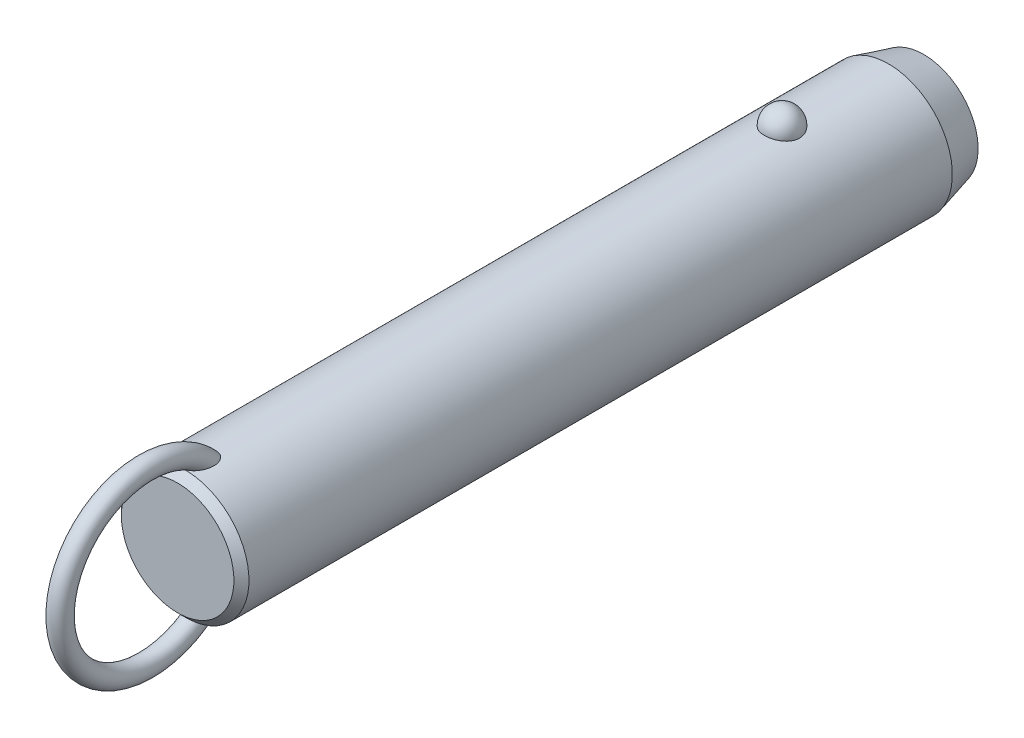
ISO-10303-21;
HEADER;
FILE_DESCRIPTION(('STEP AP214'),'2;1');
FILE_NAME('part.step','',(''),(''),'','','');
FILE_SCHEMA(('AUTOMOTIVE_DESIGN { 1 0 10303 214 1 1 1 1 }'));
ENDSEC;
DATA;
#1=APPLICATION_CONTEXT('core data for automotive mechanical design processes');
#2=APPLICATION_PROTOCOL_DEFINITION('international standard','automotive_design',2000,#1);
#3=PRODUCT_CONTEXT('',#1,'mechanical');
#4=PRODUCT('Part','Part','',(#3));
#5=PRODUCT_RELATED_PRODUCT_CATEGORY('part','',(#4));
#6=PRODUCT_DEFINITION_FORMATION('','',#4);
#7=PRODUCT_DEFINITION_CONTEXT('part definition',#1,'design');
#8=PRODUCT_DEFINITION('design','',#6,#7);
#9=PRODUCT_DEFINITION_SHAPE('','',#8);
#10=(LENGTH_UNIT() NAMED_UNIT(*) SI_UNIT(.MILLI.,.METRE.));
#11=(NAMED_UNIT(*) PLANE_ANGLE_UNIT() SI_UNIT($,.RADIAN.));
#12=(NAMED_UNIT(*) SI_UNIT($,.STERADIAN.) SOLID_ANGLE_UNIT());
#13=UNCERTAINTY_MEASURE_WITH_UNIT(LENGTH_MEASURE(1.E-05),#10,'distance_accuracy_value','');
#14=(GEOMETRIC_REPRESENTATION_CONTEXT(3) GLOBAL_UNCERTAINTY_ASSIGNED_CONTEXT((#13)) GLOBAL_UNIT_ASSIGNED_CONTEXT((#10,
#11,#12)) REPRESENTATION_CONTEXT('',''));
#15=CARTESIAN_POINT('',(0.,0.,0.));
#16=DIRECTION('',(0.,0.,1.));
#17=DIRECTION('',(1.,0.,0.));
#18=AXIS2_PLACEMENT_3D('',#15,#16,#17);
#19=CARTESIAN_POINT('',(0.,0.,104.1));
#20=DIRECTION('',(0.,0.,-1.));
#21=DIRECTION('',(-1.,0.,0.));
#22=AXIS2_PLACEMENT_3D('',#19,#20,#21);
#23=CYLINDRICAL_SURFACE('',#22,12.7);
#24=CARTESIAN_POINT('',(3.46661256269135,12.2177165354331,-3.5));
#25=CARTESIAN_POINT('',(3.4666090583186,12.2177194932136,-3.30432790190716));
#26=CARTESIAN_POINT('',(3.45063567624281,12.2222841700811,-3.10861112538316));
#27=CARTESIAN_POINT('',(3.38712451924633,12.2400345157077,-2.72271899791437));
#28=CARTESIAN_POINT('',(3.33957415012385,12.2532236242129,-2.53254588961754));
#29=CARTESIAN_POINT('',(3.2141234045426,12.286724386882,-2.16324948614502));
#30=CARTESIAN_POINT('',(3.13623639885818,12.3070329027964,-1.98412136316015));
#31=CARTESIAN_POINT('',(2.95205930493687,12.3525018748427,-1.64180592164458));
#32=CARTESIAN_POINT('',(2.84577003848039,12.3776621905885,-1.47861814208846));
#33=CARTESIAN_POINT('',(2.60688050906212,12.4301712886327,-1.17190583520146));
#34=CARTESIAN_POINT('',(2.47415697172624,12.4575299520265,-1.02847897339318));
#35=CARTESIAN_POINT('',(2.18615174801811,12.5112810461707,-0.766177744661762));
#36=CARTESIAN_POINT('',(2.03087002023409,12.5376734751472,-0.64730342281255));
#37=CARTESIAN_POINT('',(1.70237334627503,12.5864761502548,-0.437732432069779));
#38=CARTESIAN_POINT('',(1.52920948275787,12.6088972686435,-0.346958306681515));
#39=CARTESIAN_POINT('',(1.16944170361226,12.6473352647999,-0.195750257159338));
#40=CARTESIAN_POINT('',(0.982839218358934,12.663352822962,-0.135313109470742));
#41=CARTESIAN_POINT('',(0.604961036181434,12.6869706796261,-0.0473241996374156));
#42=CARTESIAN_POINT('',(0.41382314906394,12.6947125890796,-0.0192185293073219));
#43=CARTESIAN_POINT('',(0.0293827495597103,12.7014203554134,0.0051725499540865));
#44=CARTESIAN_POINT('',(-0.163919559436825,12.7003870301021,0.00146092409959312));
#45=CARTESIAN_POINT('',(-0.544374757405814,12.689735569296,-0.0373939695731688));
#46=CARTESIAN_POINT('',(-0.731575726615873,12.6802364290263,-0.0721015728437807));
#47=CARTESIAN_POINT('',(-1.09733277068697,12.6538333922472,-0.171364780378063));
#48=CARTESIAN_POINT('',(-1.27588869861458,12.6369293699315,-0.235920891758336));
#49=CARTESIAN_POINT('',(-1.6204698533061,12.5973946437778,-0.393548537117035));
#50=CARTESIAN_POINT('',(-1.78641865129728,12.5747321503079,-0.486778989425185));
#51=CARTESIAN_POINT('',(-2.10030671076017,12.5261316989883,-0.699110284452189));
#52=CARTESIAN_POINT('',(-2.24824419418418,12.5001934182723,-0.818213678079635));
#53=CARTESIAN_POINT('',(-2.52491489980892,12.4472906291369,-1.08157124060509));
#54=CARTESIAN_POINT('',(-2.65324222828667,12.4203160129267,-1.22624992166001));
#55=CARTESIAN_POINT('',(-2.88410007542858,12.3687509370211,-1.53528325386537));
#56=CARTESIAN_POINT('',(-2.98662883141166,12.3441606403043,-1.69963924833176));
#57=CARTESIAN_POINT('',(-3.16432417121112,12.2998199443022,-2.04548497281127));
#58=CARTESIAN_POINT('',(-3.23917525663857,12.2801261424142,-2.22714424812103));
#59=CARTESIAN_POINT('',(-3.35800573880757,12.248167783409,-2.6009138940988));
#60=CARTESIAN_POINT('',(-3.4019860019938,12.2359030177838,-2.79302397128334));
#61=CARTESIAN_POINT('',(-3.45784812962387,12.2202347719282,-3.18140279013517));
#62=CARTESIAN_POINT('',(-3.46986123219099,12.2167950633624,-3.37765118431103));
#63=CARTESIAN_POINT('',(-3.46186273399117,12.2190638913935,-3.76943689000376));
#64=CARTESIAN_POINT('',(-3.44185196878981,12.2247721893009,-3.96497421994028));
#65=CARTESIAN_POINT('',(-3.37048652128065,12.2446381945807,-4.34881728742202));
#66=CARTESIAN_POINT('',(-3.31928253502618,12.2587552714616,-4.53715319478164));
#67=CARTESIAN_POINT('',(-3.18693461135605,12.2938237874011,-4.90231727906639));
#68=CARTESIAN_POINT('',(-3.1057895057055,12.3147754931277,-5.07914500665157));
#69=CARTESIAN_POINT('',(-2.91506431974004,12.3613125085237,-5.41732059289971));
#70=CARTESIAN_POINT('',(-2.80533587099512,12.3869217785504,-5.57858147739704));
#71=CARTESIAN_POINT('',(-2.560414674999,12.4398525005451,-5.88013283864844));
#72=CARTESIAN_POINT('',(-2.42522099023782,12.4671740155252,-6.02042254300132));
#73=CARTESIAN_POINT('',(-2.1323357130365,12.5205965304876,-6.27662798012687));
#74=CARTESIAN_POINT('',(-1.97456596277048,12.5466928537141,-6.3924554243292));
#75=CARTESIAN_POINT('',(-1.64115839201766,12.5946384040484,-6.59583547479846));
#76=CARTESIAN_POINT('',(-1.46552179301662,12.6164879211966,-6.68339001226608));
#77=CARTESIAN_POINT('',(-1.10356050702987,12.6532533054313,-6.82682153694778));
#78=CARTESIAN_POINT('',(-0.9173913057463,12.6682500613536,-6.8830698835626));
#79=CARTESIAN_POINT('',(-0.537836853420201,12.6900288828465,-6.96386887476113));
#80=CARTESIAN_POINT('',(-0.344452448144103,12.6968119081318,-6.9884232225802));
#81=CARTESIAN_POINT('',(0.0402577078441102,12.7013667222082,-7.00496469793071));
#82=CARTESIAN_POINT('',(0.231556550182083,12.6993008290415,-6.99753844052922));
#83=CARTESIAN_POINT('',(0.610105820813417,12.6867505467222,-6.9516636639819));
#84=CARTESIAN_POINT('',(0.797356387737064,12.6762664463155,-6.913216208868));
#85=CARTESIAN_POINT('',(1.16186657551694,12.6480587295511,-6.80658431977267));
#86=CARTESIAN_POINT('',(1.33915951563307,12.6303611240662,-6.73850666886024));
#87=CARTESIAN_POINT('',(1.67968518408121,12.5896027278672,-6.5745087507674));
#88=CARTESIAN_POINT('',(1.84291705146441,12.5665416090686,-6.47858678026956));
#89=CARTESIAN_POINT('',(2.15340192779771,12.5171072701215,-6.25982455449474));
#90=CARTESIAN_POINT('',(2.30037831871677,12.4906895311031,-6.13660186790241));
#91=CARTESIAN_POINT('',(2.5717412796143,12.4376567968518,-5.86739587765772));
#92=CARTESIAN_POINT('',(2.69612388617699,12.4110417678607,-5.72140858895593));
#93=CARTESIAN_POINT('',(2.92107785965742,12.360051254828,-5.40794137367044));
#94=CARTESIAN_POINT('',(3.02121329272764,12.3357209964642,-5.24014110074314));
#95=CARTESIAN_POINT('',(3.19236291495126,12.2925446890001,-4.88969865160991));
#96=CARTESIAN_POINT('',(3.26338839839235,12.2736965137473,-4.70706226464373));
#97=CARTESIAN_POINT('',(3.36788038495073,12.245404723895,-4.35469510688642));
#98=CARTESIAN_POINT('',(3.40484026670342,12.2351018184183,-4.18605935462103));
#99=CARTESIAN_POINT('',(3.45420764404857,12.2212564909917,-3.84496058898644));
#100=CARTESIAN_POINT('',(3.46661565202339,12.2177139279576,-3.67249765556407));
#101=CARTESIAN_POINT('',(3.46661256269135,12.2177165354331,-3.5));
#102=B_SPLINE_CURVE_WITH_KNOTS('',3,(#24,#25,#26,#27,#28,#29,#30,#31,#32,#33,#34,#35,#36,#37,
#38,#39,#40,#41,#42,#43,#44,#45,#46,#47,#48,#49,#50,#51,#52,#53,#54,#55,#56,#57,#58,#59,#60,#61,
#62,#63,#64,#65,#66,#67,#68,#69,#70,#71,#72,#73,#74,#75,#76,#77,#78,#79,#80,#81,#82,#83,#84,#85,
#86,#87,#88,#89,#90,#91,#92,#93,#94,#95,#96,#97,#98,#99,#100,#101),.UNSPECIFIED.,.T.,.F.,(4,2,2,
2,2,2,2,2,2,2,2,2,2,2,2,2,2,2,2,2,2,2,2,2,2,2,2,2,2,2,2,2,2,2,2,2,2,2,4),(0.,0.586396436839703,
1.17302689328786,1.7593990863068,2.34575431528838,2.93491084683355,3.52406845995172,
4.11158733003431,4.69904375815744,5.2762784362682,5.85345931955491,6.42265312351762,
6.99185659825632,7.56427334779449,8.136746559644,8.71981013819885,9.3029135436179,
9.89247258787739,10.4820150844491,11.0691335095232,11.6562366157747,12.2405256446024,
12.8248374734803,13.412244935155,13.9996740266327,14.5891883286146,15.1786623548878,
15.7609861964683,16.3432419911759,16.9148635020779,17.4864654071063,18.0560241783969,
18.6256177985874,19.2037609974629,19.7820055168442,20.3699810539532,20.957728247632,
21.4746855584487,21.9916320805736),.UNSPECIFIED.);
#103=CARTESIAN_POINT('',(3.46661256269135,12.2177165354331,-3.5));
#104=VERTEX_POINT('',#103);
#105=EDGE_CURVE('E41',#104,#104,#102,.T.);
#106=ORIENTED_EDGE('',*,*,#105,.T.);
#107=EDGE_LOOP('',(#106));
#108=FACE_BOUND('',#107,.T.);
#109=CARTESIAN_POINT('',(0.,0.,115.3));
#110=DIRECTION('',(0.,0.,1.));
#111=DIRECTION('',(1.,0.,0.));
#112=AXIS2_PLACEMENT_3D('',#109,#110,#111);
#113=CIRCLE('',#112,12.7);
#114=CARTESIAN_POINT('',(-12.7,0.,115.3));
#115=VERTEX_POINT('',#114);
#116=EDGE_CURVE('E10',#115,#115,#113,.F.);
#117=ORIENTED_EDGE('',*,*,#116,.T.);
#118=EDGE_LOOP('',(#117));
#119=FACE_BOUND('',#118,.T.);
#120=CARTESIAN_POINT('',(-0.548122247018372,-12.6881662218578,109.043218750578));
#121=CARTESIAN_POINT('',(-0.648865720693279,-12.6838128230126,109.077926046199));
#122=CARTESIAN_POINT('',(-0.746398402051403,-12.6783867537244,109.122042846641));
#123=CARTESIAN_POINT('',(-0.93212506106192,-12.666091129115,109.226764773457));
#124=CARTESIAN_POINT('',(-1.02030388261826,-12.6592192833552,109.287396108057));
#125=CARTESIAN_POINT('',(-1.18487740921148,-12.6448747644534,109.421847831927));
#126=CARTESIAN_POINT('',(-1.26134296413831,-12.637406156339,109.495582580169));
#127=CARTESIAN_POINT('',(-1.4023120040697,-12.6225412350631,109.653604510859));
#128=CARTESIAN_POINT('',(-1.46681470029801,-12.6151449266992,109.73789238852));
#129=CARTESIAN_POINT('',(-1.60714786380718,-12.5981718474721,109.949657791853));
#130=CARTESIAN_POINT('',(-1.67725126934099,-12.588900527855,110.080962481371));
#131=CARTESIAN_POINT('',(-1.79536591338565,-12.5725964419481,110.353247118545));
#132=CARTESIAN_POINT('',(-1.84333535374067,-12.5655679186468,110.494244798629));
#133=CARTESIAN_POINT('',(-1.93422576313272,-12.5519624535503,110.837645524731));
#134=CARTESIAN_POINT('',(-1.96788773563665,-12.5466298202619,111.042557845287));
#135=CARTESIAN_POINT('',(-1.9941399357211,-12.542463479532,111.351760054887));
#136=CARTESIAN_POINT('',(-1.99883864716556,-12.5417153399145,111.455298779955));
#137=CARTESIAN_POINT('',(-2.00078003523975,-12.5414074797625,111.66245124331));
#138=CARTESIAN_POINT('',(-1.99802449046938,-12.5418474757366,111.766064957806));
#139=CARTESIAN_POINT('',(-1.98336733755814,-12.5441750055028,112.010320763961));
#140=CARTESIAN_POINT('',(-1.96851430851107,-12.5465291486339,112.150780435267));
#141=CARTESIAN_POINT('',(-1.92707089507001,-12.5529612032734,112.429960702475));
#142=CARTESIAN_POINT('',(-1.90047458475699,-12.5570399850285,112.568680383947));
#143=CARTESIAN_POINT('',(-1.83619120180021,-12.5666008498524,112.84341135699));
#144=CARTESIAN_POINT('',(-1.79850828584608,-12.57208240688,112.979423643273));
#145=CARTESIAN_POINT('',(-1.71223796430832,-12.5841228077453,113.247842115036));
#146=CARTESIAN_POINT('',(-1.66365679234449,-12.5906810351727,113.380250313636));
#147=CARTESIAN_POINT('',(-1.5780450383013,-12.6016176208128,113.58548877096));
#148=CARTESIAN_POINT('',(-1.54477252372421,-12.6057501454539,113.659914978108));
#149=CARTESIAN_POINT('',(-1.47424480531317,-12.6141930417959,113.806839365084));
#150=CARTESIAN_POINT('',(-1.43699041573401,-12.6185033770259,113.879337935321));
#151=CARTESIAN_POINT('',(-1.35825795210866,-12.6272207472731,114.021892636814));
#152=CARTESIAN_POINT('',(-1.31678520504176,-12.6316276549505,114.091951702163));
#153=CARTESIAN_POINT('',(-1.22917793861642,-12.6404532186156,114.229070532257));
#154=CARTESIAN_POINT('',(-1.18304514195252,-12.6448718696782,114.296131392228));
#155=CARTESIAN_POINT('',(-1.07246411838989,-12.6547893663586,114.443874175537));
#156=CARTESIAN_POINT('',(-1.00642239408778,-12.6602600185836,114.523384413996));
#157=CARTESIAN_POINT('',(-0.864441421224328,-12.6707460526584,114.673169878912));
#158=CARTESIAN_POINT('',(-0.78851691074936,-12.6757620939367,114.743458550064));
#159=CARTESIAN_POINT('',(-0.652215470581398,-12.6833591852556,114.848680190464));
#160=CARTESIAN_POINT('',(-0.594982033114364,-12.6861973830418,114.887624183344));
#161=CARTESIAN_POINT('',(-0.475269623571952,-12.6912445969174,114.956489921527));
#162=CARTESIAN_POINT('',(-0.412800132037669,-12.6934547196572,114.986427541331));
#163=CARTESIAN_POINT('',(-0.295749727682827,-12.6966636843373,115.029756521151));
#164=CARTESIAN_POINT('',(-0.241949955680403,-12.6978134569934,115.045218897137));
#165=CARTESIAN_POINT('',(-0.132508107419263,-12.6994261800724,115.066884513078));
#166=CARTESIAN_POINT('',(-0.0768679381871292,-12.6998898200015,115.073097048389));
#167=CARTESIAN_POINT('',(0.0347696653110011,-12.7000752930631,115.075583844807));
#168=CARTESIAN_POINT('',(0.0907676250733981,-12.6997954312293,115.071835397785));
#169=CARTESIAN_POINT('',(0.201283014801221,-12.6985255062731,115.054788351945));
#170=CARTESIAN_POINT('',(0.255799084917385,-12.6975348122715,115.041481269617));
#171=CARTESIAN_POINT('',(0.376042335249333,-12.6946091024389,115.00203792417));
#172=CARTESIAN_POINT('',(0.44095085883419,-12.6924943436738,114.973449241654));
#173=CARTESIAN_POINT('',(0.565350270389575,-12.6875639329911,114.906323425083));
#174=CARTESIAN_POINT('',(0.624828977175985,-12.6847467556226,114.867764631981));
#175=CARTESIAN_POINT('',(0.774116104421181,-12.6767252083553,114.756949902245));
#176=CARTESIAN_POINT('',(0.859449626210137,-12.6711344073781,114.678760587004));
#177=CARTESIAN_POINT('',(1.01789440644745,-12.6593922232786,114.510943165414));
#178=CARTESIAN_POINT('',(1.09096902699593,-12.653239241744,114.421282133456));
#179=CARTESIAN_POINT('',(1.22268793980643,-12.6411674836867,114.240265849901));
#180=CARTESIAN_POINT('',(1.28193986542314,-12.6352572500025,114.149345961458));
#181=CARTESIAN_POINT('',(1.39259777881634,-12.6235401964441,113.962792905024));
#182=CARTESIAN_POINT('',(1.44399707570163,-12.6177334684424,113.867155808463));
#183=CARTESIAN_POINT('',(1.53972870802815,-12.6064093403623,113.672273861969));
#184=CARTESIAN_POINT('',(1.58405262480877,-12.6008922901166,113.573024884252));
#185=CARTESIAN_POINT('',(1.66600705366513,-12.5903187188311,113.371772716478));
#186=CARTESIAN_POINT('',(1.70363651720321,-12.5852622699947,113.269769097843));
#187=CARTESIAN_POINT('',(1.77545379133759,-12.5753406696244,113.054358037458));
#188=CARTESIAN_POINT('',(1.80903453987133,-12.5705328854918,112.940745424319));
#189=CARTESIAN_POINT('',(1.86844163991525,-12.5618400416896,112.711457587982));
#190=CARTESIAN_POINT('',(1.89426665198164,-12.5579551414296,112.595782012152));
#191=CARTESIAN_POINT('',(1.9378546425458,-12.5513030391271,112.363007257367));
#192=CARTESIAN_POINT('',(1.9556264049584,-12.5485346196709,112.245909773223));
#193=CARTESIAN_POINT('',(1.98264463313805,-12.5442934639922,112.010747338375));
#194=CARTESIAN_POINT('',(1.99189298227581,-12.5428204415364,111.89268260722));
#195=CARTESIAN_POINT('',(2.00416068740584,-12.540871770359,111.580622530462));
#196=CARTESIAN_POINT('',(1.99944433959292,-12.541631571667,111.386229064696));
#197=CARTESIAN_POINT('',(1.96113755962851,-12.5476846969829,111.000309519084));
#198=CARTESIAN_POINT('',(1.92758341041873,-12.5529723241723,110.808780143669));
#199=CARTESIAN_POINT('',(1.83934342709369,-12.5661532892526,110.482272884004));
#200=CARTESIAN_POINT('',(1.79215440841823,-12.5730485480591,110.34524997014));
#201=CARTESIAN_POINT('',(1.67676242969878,-12.588958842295,110.080445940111));
#202=CARTESIAN_POINT('',(1.60859050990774,-12.597970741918,109.952651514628));
#203=CARTESIAN_POINT('',(1.46583832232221,-12.6152829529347,109.735800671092));
#204=CARTESIAN_POINT('',(1.39525727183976,-12.6233659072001,109.64410500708));
#205=CARTESIAN_POINT('',(1.23992594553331,-12.6395676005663,109.473485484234));
#206=CARTESIAN_POINT('',(1.1551793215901,-12.6476863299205,109.394558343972));
#207=CARTESIAN_POINT('',(0.971995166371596,-12.6630846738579,109.252643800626));
#208=CARTESIAN_POINT('',(0.873456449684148,-12.6703572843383,109.189784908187));
#209=CARTESIAN_POINT('',(0.665847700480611,-12.6829569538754,109.084487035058));
#210=CARTESIAN_POINT('',(0.556784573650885,-12.688285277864,109.042034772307));
#211=CARTESIAN_POINT('',(0.347338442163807,-12.6956226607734,108.984443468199));
#212=CARTESIAN_POINT('',(0.247759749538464,-12.6979816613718,108.966399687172));
#213=CARTESIAN_POINT('',(0.0470218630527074,-12.7003077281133,108.948600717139));
#214=CARTESIAN_POINT('',(-0.0541350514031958,-12.7002779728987,108.948821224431));
#215=CARTESIAN_POINT('',(-0.221414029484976,-12.6982482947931,108.964363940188));
#216=CARTESIAN_POINT('',(-0.288055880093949,-12.6969033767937,108.974666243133));
#217=CARTESIAN_POINT('',(-0.419599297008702,-12.6932369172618,109.00313489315));
#218=CARTESIAN_POINT('',(-0.484501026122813,-12.6909154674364,109.021300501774));
#219=CARTESIAN_POINT('',(-0.548122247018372,-12.6881662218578,109.043218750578));
#220=B_SPLINE_CURVE_WITH_KNOTS('',3,(#120,#121,#122,#123,#124,#125,#126,#127,#128,#129,#130,
#131,#132,#133,#134,#135,#136,#137,#138,#139,#140,#141,#142,#143,#144,#145,#146,#147,#148,#149,
#150,#151,#152,#153,#154,#155,#156,#157,#158,#159,#160,#161,#162,#163,#164,#165,#166,#167,#168,
#169,#170,#171,#172,#173,#174,#175,#176,#177,#178,#179,#180,#181,#182,#183,#184,#185,#186,#187,
#188,#189,#190,#191,#192,#193,#194,#195,#196,#197,#198,#199,#200,#201,#202,#203,#204,#205,#206,
#207,#208,#209,#210,#211,#212,#213,#214,#215,#216,#217,#218,#219),.UNSPECIFIED.,.T.,.F.,(4,2,2,
2,2,2,2,2,2,2,2,2,2,2,2,2,2,2,2,2,2,2,2,2,2,2,2,2,2,2,2,2,2,2,2,2,2,2,2,2,2,2,2,2,2,2,2,2,2,4),
(0.,0.31964225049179,0.639794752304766,0.957927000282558,1.27608021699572,1.72100165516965,
2.16675988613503,2.78630021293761,3.0970578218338,3.40774128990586,3.83096358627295,
4.2543996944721,4.67767724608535,5.10071330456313,5.34550297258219,5.59024267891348,
5.83467707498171,6.07902143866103,6.38891080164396,6.69834321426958,6.90560910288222,
7.11250749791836,7.27977315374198,7.44687060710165,7.61434932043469,7.78197685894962,
7.99365544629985,8.20579780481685,8.55147335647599,8.89816429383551,9.22375138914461,
9.5496143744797,9.87586224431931,10.202161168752,10.557587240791,10.9130746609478,
11.2681734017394,11.6231936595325,12.2046601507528,12.7853961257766,13.219164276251,
13.6522938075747,13.9989174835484,14.3454519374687,14.6946768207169,15.0436740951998,
15.3457513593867,15.6474266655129,15.8493051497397,16.0511646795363),.UNSPECIFIED.);
#221=CARTESIAN_POINT('',(-0.548122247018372,-12.6881662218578,109.043218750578));
#222=VERTEX_POINT('',#221);
#223=EDGE_CURVE('E59',#222,#222,#220,.T.);
#224=ORIENTED_EDGE('',*,*,#223,.T.);
#225=EDGE_LOOP('',(#224));
#226=FACE_BOUND('',#225,.T.);
#227=CARTESIAN_POINT('',(-0.548122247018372,12.6881662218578,109.043218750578));
#228=CARTESIAN_POINT('',(-0.459436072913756,12.6919968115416,109.012673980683));
#229=CARTESIAN_POINT('',(-0.368189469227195,12.6949996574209,108.989391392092));
#230=CARTESIAN_POINT('',(-0.183024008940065,12.6990186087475,108.958406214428));
#231=CARTESIAN_POINT('',(-0.0891049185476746,12.7000345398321,108.950704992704));
#232=CARTESIAN_POINT('',(0.0987147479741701,12.6999636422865,108.951245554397));
#233=CARTESIAN_POINT('',(0.192615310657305,12.6988761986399,108.959492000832));
#234=CARTESIAN_POINT('',(0.377658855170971,12.6947211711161,108.991551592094));
#235=CARTESIAN_POINT('',(0.468801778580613,12.6916535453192,109.015365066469));
#236=CARTESIAN_POINT('',(0.645809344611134,12.6838788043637,109.07745651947));
#237=CARTESIAN_POINT('',(0.731679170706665,12.6791733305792,109.115720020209));
#238=CARTESIAN_POINT('',(0.896315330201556,12.6686004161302,109.205120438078));
#239=CARTESIAN_POINT('',(0.975080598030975,12.6627328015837,109.256259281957));
#240=CARTESIAN_POINT('',(1.12963655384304,12.6499161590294,109.37367820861));
#241=CARTESIAN_POINT('',(1.20478673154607,12.6429194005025,109.440792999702));
#242=CARTESIAN_POINT('',(1.34448241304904,12.6288282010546,109.58522507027));
#243=CARTESIAN_POINT('',(1.40902173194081,12.621733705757,109.662548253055));
#244=CARTESIAN_POINT('',(1.55208211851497,12.6050877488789,109.859247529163));
#245=CARTESIAN_POINT('',(1.62510490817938,12.5957546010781,109.982654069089));
#246=CARTESIAN_POINT('',(1.7501904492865,12.5789823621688,110.239769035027));
#247=CARTESIAN_POINT('',(1.80221377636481,12.5715468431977,110.373496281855));
#248=CARTESIAN_POINT('',(1.90309965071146,12.5567434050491,110.698351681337));
#249=CARTESIAN_POINT('',(1.94342317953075,12.5504515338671,110.892161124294));
#250=CARTESIAN_POINT('',(1.99332997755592,12.5426147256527,111.28378810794));
#251=CARTESIAN_POINT('',(2.00285305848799,12.5410790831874,111.481612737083));
#252=CARTESIAN_POINT('',(1.99678999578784,12.5420407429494,111.816642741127));
#253=CARTESIAN_POINT('',(1.98794117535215,12.5434564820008,111.954042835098));
#254=CARTESIAN_POINT('',(1.95865119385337,12.5480641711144,112.227639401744));
#255=CARTESIAN_POINT('',(1.93820436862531,12.5512569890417,112.363835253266));
#256=CARTESIAN_POINT('',(1.88647896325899,12.5591352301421,112.634249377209));
#257=CARTESIAN_POINT('',(1.85518800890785,12.5638223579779,112.76846520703));
#258=CARTESIAN_POINT('',(1.78217886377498,12.5743868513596,113.033936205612));
#259=CARTESIAN_POINT('',(1.74046509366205,12.5802637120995,113.165192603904));
#260=CARTESIAN_POINT('',(1.66024095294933,12.5910571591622,113.386085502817));
#261=CARTESIAN_POINT('',(1.62434772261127,12.5957535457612,113.476690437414));
#262=CARTESIAN_POINT('',(1.5470900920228,12.6054762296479,113.655512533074));
#263=CARTESIAN_POINT('',(1.50572681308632,12.6105024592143,113.743730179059));
#264=CARTESIAN_POINT('',(1.41728020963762,12.620748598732,113.916932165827));
#265=CARTESIAN_POINT('',(1.37021377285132,12.625967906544,114.001925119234));
#266=CARTESIAN_POINT('',(1.2696962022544,12.6364721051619,114.168007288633));
#267=CARTESIAN_POINT('',(1.21624929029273,12.6417569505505,114.249099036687));
#268=CARTESIAN_POINT('',(1.10304413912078,12.6521331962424,114.404702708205));
#269=CARTESIAN_POINT('',(1.04340936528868,12.657226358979,114.479303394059));
#270=CARTESIAN_POINT('',(0.91591933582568,12.6670906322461,114.621324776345));
#271=CARTESIAN_POINT('',(0.84806456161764,12.6718617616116,114.68874589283));
#272=CARTESIAN_POINT('',(0.717035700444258,12.67987711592,114.800624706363));
#273=CARTESIAN_POINT('',(0.655526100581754,12.6832377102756,114.846997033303));
#274=CARTESIAN_POINT('',(0.525985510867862,12.6892676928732,114.929619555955));
#275=CARTESIAN_POINT('',(0.45796984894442,12.6919386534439,114.965892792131));
#276=CARTESIAN_POINT('',(0.334859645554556,12.695691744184,115.016657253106));
#277=CARTESIAN_POINT('',(0.281116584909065,12.6970073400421,115.034373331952));
#278=CARTESIAN_POINT('',(0.171425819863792,12.6989609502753,115.060642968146));
#279=CARTESIAN_POINT('',(0.11548082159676,12.699599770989,115.069207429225));
#280=CARTESIAN_POINT('',(0.00272618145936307,12.7001251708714,115.076253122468));
#281=CARTESIAN_POINT('',(-0.0540859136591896,12.7000089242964,115.074696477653));
#282=CARTESIAN_POINT('',(-0.166544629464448,12.6990328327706,115.061600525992));
#283=CARTESIAN_POINT('',(-0.222190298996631,12.6981724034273,115.050053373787));
#284=CARTESIAN_POINT('',(-0.342018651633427,12.695562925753,115.014912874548));
#285=CARTESIAN_POINT('',(-0.405606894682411,12.6936676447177,114.98933225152));
#286=CARTESIAN_POINT('',(-0.527815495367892,12.6891754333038,114.928311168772));
#287=CARTESIAN_POINT('',(-0.586425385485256,12.6865770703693,114.892850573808));
#288=CARTESIAN_POINT('',(-0.731842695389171,12.6792129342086,114.791496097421));
#289=CARTESIAN_POINT('',(-0.814709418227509,12.6740767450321,114.7200395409));
#290=CARTESIAN_POINT('',(-0.969101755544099,12.6632083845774,114.56589007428));
#291=CARTESIAN_POINT('',(-1.04059564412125,12.6574746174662,114.483166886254));
#292=CARTESIAN_POINT('',(-1.16981116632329,12.6461638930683,114.315809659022));
#293=CARTESIAN_POINT('',(-1.22811369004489,12.6405994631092,114.231616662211));
#294=CARTESIAN_POINT('',(-1.33743405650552,12.6295007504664,114.058579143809));
#295=CARTESIAN_POINT('',(-1.38844577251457,12.6239664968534,113.969730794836));
#296=CARTESIAN_POINT('',(-1.48400702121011,12.6130898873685,113.788389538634));
#297=CARTESIAN_POINT('',(-1.52854232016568,12.6077479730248,113.695889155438));
#298=CARTESIAN_POINT('',(-1.6115011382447,12.5974127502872,113.508160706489));
#299=CARTESIAN_POINT('',(-1.64992317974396,12.5924195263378,113.412931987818));
#300=CARTESIAN_POINT('',(-1.73468589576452,12.581070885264,113.18289362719));
#301=CARTESIAN_POINT('',(-1.77831261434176,12.5749388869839,113.047066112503));
#302=CARTESIAN_POINT('',(-1.85439734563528,12.5639437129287,112.772212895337));
#303=CARTESIAN_POINT('',(-1.88684994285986,12.5590811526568,112.633185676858));
#304=CARTESIAN_POINT('',(-1.94008483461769,12.550968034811,112.35309235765));
#305=CARTESIAN_POINT('',(-1.96088706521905,12.5477147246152,112.212030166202));
#306=CARTESIAN_POINT('',(-1.99000539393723,12.5431291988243,111.928668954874));
#307=CARTESIAN_POINT('',(-1.99832911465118,12.5417958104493,111.786370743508));
#308=CARTESIAN_POINT('',(-2.00166624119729,12.5412674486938,111.457627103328));
#309=CARTESIAN_POINT('',(-1.99178843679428,12.5428579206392,111.271088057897));
#310=CARTESIAN_POINT('',(-1.9445518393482,12.5502731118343,110.90162404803));
#311=CARTESIAN_POINT('',(-1.90724032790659,12.5560905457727,110.718693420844));
#312=CARTESIAN_POINT('',(-1.81330718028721,12.5699462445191,110.404848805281));
#313=CARTESIAN_POINT('',(-1.76338820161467,12.5771273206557,110.271910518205));
#314=CARTESIAN_POINT('',(-1.64305018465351,12.593414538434,110.015681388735));
#315=CARTESIAN_POINT('',(-1.57265346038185,12.6025185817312,109.892380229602));
#316=CARTESIAN_POINT('',(-1.42634956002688,12.6198178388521,109.683564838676));
#317=CARTESIAN_POINT('',(-1.35423772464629,12.6278405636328,109.595384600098));
#318=CARTESIAN_POINT('',(-1.19645664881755,12.6437632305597,109.432107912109));
#319=CARTESIAN_POINT('',(-1.11080536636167,12.6516633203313,109.356994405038));
#320=CARTESIAN_POINT('',(-0.947219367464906,12.6648319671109,109.237811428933));
#321=CARTESIAN_POINT('',(-0.871624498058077,12.670300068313,109.190541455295));
#322=CARTESIAN_POINT('',(-0.714161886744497,12.6801492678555,109.1077413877));
#323=CARTESIAN_POINT('',(-0.632295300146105,12.684530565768,109.07220913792));
#324=CARTESIAN_POINT('',(-0.548122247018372,12.6881662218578,109.043218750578));
#325=B_SPLINE_CURVE_WITH_KNOTS('',3,(#227,#228,#229,#230,#231,#232,#233,#234,#235,#236,#237,
#238,#239,#240,#241,#242,#243,#244,#245,#246,#247,#248,#249,#250,#251,#252,#253,#254,#255,#256,
#257,#258,#259,#260,#261,#262,#263,#264,#265,#266,#267,#268,#269,#270,#271,#272,#273,#274,#275,
#276,#277,#278,#279,#280,#281,#282,#283,#284,#285,#286,#287,#288,#289,#290,#291,#292,#293,#294,
#295,#296,#297,#298,#299,#300,#301,#302,#303,#304,#305,#306,#307,#308,#309,#310,#311,#312,#313,
#314,#315,#316,#317,#318,#319,#320,#321,#322,#323,#324),.UNSPECIFIED.,.T.,.F.,(4,2,2,2,2,2,2,2,
2,2,2,2,2,2,2,2,2,2,2,2,2,2,2,2,2,2,2,2,2,2,2,2,2,2,2,2,2,2,2,2,2,2,2,2,2,2,2,2,4),(0.,
0.281328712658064,0.562682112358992,0.844117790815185,1.12555942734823,1.40671982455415,
1.68792232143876,1.98972294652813,2.29169886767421,2.72039860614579,3.14989948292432,
3.74084916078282,4.33295293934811,4.74554109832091,5.15833092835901,5.57159335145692,
5.98468079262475,6.2772277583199,6.56971484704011,6.86135609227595,7.15280542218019,
7.43927407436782,7.72572595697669,7.95635862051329,8.18646071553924,8.35559393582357,
8.52452541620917,8.69408946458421,8.86378678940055,9.06834348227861,9.27332014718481,
9.60010414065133,9.92778432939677,10.2350252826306,10.5425229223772,10.8506864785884,
11.1589244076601,11.5867893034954,12.0148612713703,12.4421984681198,12.8692745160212,
13.4279365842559,13.9856380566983,14.4107062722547,14.8353130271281,15.1765567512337,
15.5173516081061,15.7844129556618,16.051425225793),.UNSPECIFIED.);
#326=CARTESIAN_POINT('',(-0.548122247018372,12.6881662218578,109.043218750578));
#327=VERTEX_POINT('',#326);
#328=EDGE_CURVE('E66',#327,#327,#325,.T.);
#329=ORIENTED_EDGE('',*,*,#328,.T.);
#330=EDGE_LOOP('',(#329));
#331=FACE_BOUND('',#330,.T.);
#332=CARTESIAN_POINT('',(0.,0.,-24.6999999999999));
#333=DIRECTION('',(0.,0.,-1.));
#334=DIRECTION('',(-1.,0.,0.));
#335=AXIS2_PLACEMENT_3D('',#332,#333,#334);
#336=CIRCLE('',#335,12.7);
#337=CARTESIAN_POINT('',(-12.7,0.,-24.6999999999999));
#338=VERTEX_POINT('',#337);
#339=EDGE_CURVE('E56',#338,#338,#336,.F.);
#340=ORIENTED_EDGE('',*,*,#339,.T.);
#341=EDGE_LOOP('',(#340));
#342=FACE_BOUND('',#341,.T.);
#343=ADVANCED_FACE('F37',(#108,#119,#226,#331,#342),#23,.T.);
#344=CARTESIAN_POINT('',(0.,0.,-31.7));
#345=DIRECTION('',(0.,0.,-1.));
#346=DIRECTION('',(-1.,0.,0.));
#347=AXIS2_PLACEMENT_3D('',#344,#345,#346);
#348=PLANE('',#347);
#349=CARTESIAN_POINT('',(0.,0.,-31.7));
#350=DIRECTION('',(0.,0.,-1.));
#351=DIRECTION('',(-1.,0.,0.));
#352=AXIS2_PLACEMENT_3D('',#349,#350,#351);
#353=CIRCLE('',#352,10.8243556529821);
#354=CARTESIAN_POINT('',(-10.8243556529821,0.,-31.7));
#355=VERTEX_POINT('',#354);
#356=EDGE_CURVE('E65',#355,#355,#353,.T.);
#357=ORIENTED_EDGE('',*,*,#356,.T.);
#358=EDGE_LOOP('',(#357));
#359=FACE_BOUND('',#358,.T.);
#360=ADVANCED_FACE('F84',(#359),#348,.T.);
#361=CARTESIAN_POINT('',(0.,0.,-31.7));
#362=DIRECTION('',(0.,0.,1.));
#363=DIRECTION('',(1.,0.,0.));
#364=AXIS2_PLACEMENT_3D('',#361,#362,#363);
#365=CONICAL_SURFACE('',#364,10.8243556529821,0.261799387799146);
#366=ORIENTED_EDGE('',*,*,#339,.F.);
#367=EDGE_LOOP('',(#366));
#368=FACE_BOUND('',#367,.T.);
#369=ORIENTED_EDGE('',*,*,#356,.F.);
#370=EDGE_LOOP('',(#369));
#371=FACE_BOUND('',#370,.T.);
#372=ADVANCED_FACE('F82',(#368,#371),#365,.T.);
#373=CARTESIAN_POINT('',(0.,0.,116.8));
#374=DIRECTION('',(0.,0.,1.));
#375=DIRECTION('',(1.,0.,0.));
#376=AXIS2_PLACEMENT_3D('',#373,#374,#375);
#377=PLANE('',#376);
#378=CARTESIAN_POINT('',(0.,0.,116.8));
#379=DIRECTION('',(0.,0.,1.));
#380=DIRECTION('',(1.,0.,0.));
#381=AXIS2_PLACEMENT_3D('',#378,#379,#380);
#382=CIRCLE('',#381,11.2);
#383=CARTESIAN_POINT('',(-11.2,0.,116.8));
#384=VERTEX_POINT('',#383);
#385=EDGE_CURVE('E50',#384,#384,#382,.T.);
#386=ORIENTED_EDGE('',*,*,#385,.T.);
#387=EDGE_LOOP('',(#386));
#388=FACE_BOUND('',#387,.T.);
#389=ADVANCED_FACE('F76',(#388),#377,.T.);
#390=CARTESIAN_POINT('',(0.,0.,123.15));
#391=DIRECTION('',(1.,0.,0.));
#392=DIRECTION('',(0.,0.,-1.));
#393=AXIS2_PLACEMENT_3D('',#390,#391,#392);
#394=TOROIDAL_SURFACE('',#393,17.05,2.);
#395=ORIENTED_EDGE('',*,*,#328,.F.);
#396=EDGE_LOOP('',(#395));
#397=FACE_BOUND('',#396,.T.);
#398=ORIENTED_EDGE('',*,*,#223,.F.);
#399=EDGE_LOOP('',(#398));
#400=FACE_BOUND('',#399,.T.);
#401=ADVANCED_FACE('F72',(#397,#400),#394,.T.);
#402=CARTESIAN_POINT('',(0.,0.,116.8));
#403=DIRECTION('',(0.,0.,-1.));
#404=DIRECTION('',(-1.,0.,0.));
#405=AXIS2_PLACEMENT_3D('',#402,#403,#404);
#406=CONICAL_SURFACE('',#405,11.2,0.785398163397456);
#407=CARTESIAN_POINT('',(-12.7,0.,115.3));
#408=CARTESIAN_POINT('',(-12.684375,0.,115.315625));
#409=CARTESIAN_POINT('',(-12.66875,0.,115.33125));
#410=CARTESIAN_POINT('',(-12.6375,0.,115.3625));
#411=CARTESIAN_POINT('',(-12.621875,0.,115.378125));
#412=CARTESIAN_POINT('',(-12.590625,0.,115.409375));
#413=CARTESIAN_POINT('',(-12.575,0.,115.425));
#414=CARTESIAN_POINT('',(-12.54375,0.,115.45625));
#415=CARTESIAN_POINT('',(-12.528125,0.,115.471875));
#416=CARTESIAN_POINT('',(-12.496875,0.,115.503125));
#417=CARTESIAN_POINT('',(-12.48125,0.,115.51875));
#418=CARTESIAN_POINT('',(-12.45,0.,115.55));
#419=CARTESIAN_POINT('',(-12.434375,0.,115.565625));
#420=CARTESIAN_POINT('',(-12.403125,0.,115.596875));
#421=CARTESIAN_POINT('',(-12.3875,0.,115.6125));
#422=CARTESIAN_POINT('',(-12.35625,0.,115.64375));
#423=CARTESIAN_POINT('',(-12.340625,0.,115.659375));
#424=CARTESIAN_POINT('',(-12.309375,0.,115.690625));
#425=CARTESIAN_POINT('',(-12.29375,0.,115.70625));
#426=CARTESIAN_POINT('',(-12.2625,0.,115.7375));
#427=CARTESIAN_POINT('',(-12.246875,0.,115.753125));
#428=CARTESIAN_POINT('',(-12.215625,0.,115.784375));
#429=CARTESIAN_POINT('',(-12.2,0.,115.8));
#430=CARTESIAN_POINT('',(-12.16875,0.,115.83125));
#431=CARTESIAN_POINT('',(-12.153125,0.,115.846875));
#432=CARTESIAN_POINT('',(-12.121875,0.,115.878125));
#433=CARTESIAN_POINT('',(-12.10625,0.,115.89375));
#434=CARTESIAN_POINT('',(-12.075,0.,115.925));
#435=CARTESIAN_POINT('',(-12.059375,0.,115.940625));
#436=CARTESIAN_POINT('',(-12.028125,0.,115.971875));
#437=CARTESIAN_POINT('',(-12.0125,0.,115.9875));
#438=CARTESIAN_POINT('',(-11.98125,0.,116.01875));
#439=CARTESIAN_POINT('',(-11.965625,0.,116.034375));
#440=CARTESIAN_POINT('',(-11.934375,0.,116.065625));
#441=CARTESIAN_POINT('',(-11.91875,0.,116.08125));
#442=CARTESIAN_POINT('',(-11.8875,0.,116.1125));
#443=CARTESIAN_POINT('',(-11.871875,0.,116.128125));
#444=CARTESIAN_POINT('',(-11.840625,0.,116.159375));
#445=CARTESIAN_POINT('',(-11.825,0.,116.175));
#446=CARTESIAN_POINT('',(-11.79375,0.,116.20625));
#447=CARTESIAN_POINT('',(-11.778125,0.,116.221875));
#448=CARTESIAN_POINT('',(-11.746875,0.,116.253125));
#449=CARTESIAN_POINT('',(-11.73125,0.,116.26875));
#450=CARTESIAN_POINT('',(-11.7,0.,116.3));
#451=CARTESIAN_POINT('',(-11.684375,0.,116.315625));
#452=CARTESIAN_POINT('',(-11.653125,0.,116.346875));
#453=CARTESIAN_POINT('',(-11.6375,0.,116.3625));
#454=CARTESIAN_POINT('',(-11.60625,0.,116.39375));
#455=CARTESIAN_POINT('',(-11.590625,0.,116.409375));
#456=CARTESIAN_POINT('',(-11.559375,0.,116.440625));
#457=CARTESIAN_POINT('',(-11.54375,0.,116.45625));
#458=CARTESIAN_POINT('',(-11.5125,0.,116.4875));
#459=CARTESIAN_POINT('',(-11.496875,0.,116.503125));
#460=CARTESIAN_POINT('',(-11.465625,0.,116.534375));
#461=CARTESIAN_POINT('',(-11.45,0.,116.55));
#462=CARTESIAN_POINT('',(-11.41875,0.,116.58125));
#463=CARTESIAN_POINT('',(-11.403125,0.,116.596875));
#464=CARTESIAN_POINT('',(-11.371875,0.,116.628125));
#465=CARTESIAN_POINT('',(-11.35625,0.,116.64375));
#466=CARTESIAN_POINT('',(-11.325,0.,116.675));
#467=CARTESIAN_POINT('',(-11.309375,0.,116.690625));
#468=CARTESIAN_POINT('',(-11.278125,0.,116.721875));
#469=CARTESIAN_POINT('',(-11.2625,0.,116.7375));
#470=CARTESIAN_POINT('',(-11.23125,0.,116.76875));
#471=CARTESIAN_POINT('',(-11.215625,0.,116.784375));
#472=CARTESIAN_POINT('',(-11.2,0.,116.8));
#473=B_SPLINE_CURVE_WITH_KNOTS('',3,(#407,#408,#409,#410,#411,#412,#413,#414,#415,#416,#417,
#418,#419,#420,#421,#422,#423,#424,#425,#426,#427,#428,#429,#430,#431,#432,#433,#434,#435,#436,
#437,#438,#439,#440,#441,#442,#443,#444,#445,#446,#447,#448,#449,#450,#451,#452,#453,#454,#455,
#456,#457,#458,#459,#460,#461,#462,#463,#464,#465,#466,#467,#468,#469,#470,#471,#472),
.UNSPECIFIED.,.F.,.F.,(4,2,2,2,2,2,2,2,2,2,2,2,2,2,2,2,2,2,2,2,2,2,2,2,2,2,2,2,2,2,2,2,4),(0.,
0.0662912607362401,0.13258252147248,0.19887378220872,0.26516504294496,0.331456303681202,
0.397747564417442,0.464038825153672,0.530330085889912,0.596621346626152,0.662912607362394,
0.729203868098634,0.795495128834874,0.861786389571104,0.928077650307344,0.994368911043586,
1.06066017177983,1.12695143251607,1.19324269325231,1.25953395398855,1.32582521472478,
1.39211647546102,1.45840773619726,1.5246989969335,1.59099025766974,1.65728151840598,
1.72357277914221,1.78986403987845,1.85615530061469,1.92244656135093,1.98873782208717,
2.05502908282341,2.12132034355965),.UNSPECIFIED.);
#474=EDGE_CURVE('BSEAM39',#115,#384,#473,.T.);
#475=ORIENTED_EDGE('',*,*,#116,.F.);
#476=ORIENTED_EDGE('',*,*,#385,.F.);
#477=ORIENTED_EDGE('',*,*,#474,.T.);
#478=ORIENTED_EDGE('',*,*,#474,.F.);
#479=EDGE_LOOP('',(#475,#477,#476,#478));
#480=FACE_BOUND('',#479,.T.);
#481=ADVANCED_FACE('F39',(#480),#406,.T.);
#482=CARTESIAN_POINT('',(0.,12.7,-3.5));
#483=DIRECTION('',(0.,1.,0.));
#484=DIRECTION('',(0.,0.,-1.));
#485=AXIS2_PLACEMENT_3D('',#482,#483,#484);
#486=SPHERICAL_SURFACE('',#485,3.5);
#487=ORIENTED_EDGE('',*,*,#105,.F.);
#488=EDGE_LOOP('',(#487));
#489=FACE_BOUND('',#488,.T.);
#490=ADVANCED_FACE('F78',(#489),#486,.T.);
#491=CLOSED_SHELL('',(#343,#360,#372,#389,#401,#481,#490));
#492=MANIFOLD_SOLID_BREP('B2',#491);
#493=ADVANCED_BREP_SHAPE_REPRESENTATION('',(#18,#492),#14);
#494=SHAPE_DEFINITION_REPRESENTATION(#9,#493);
ENDSEC;
END-ISO-10303-21;
